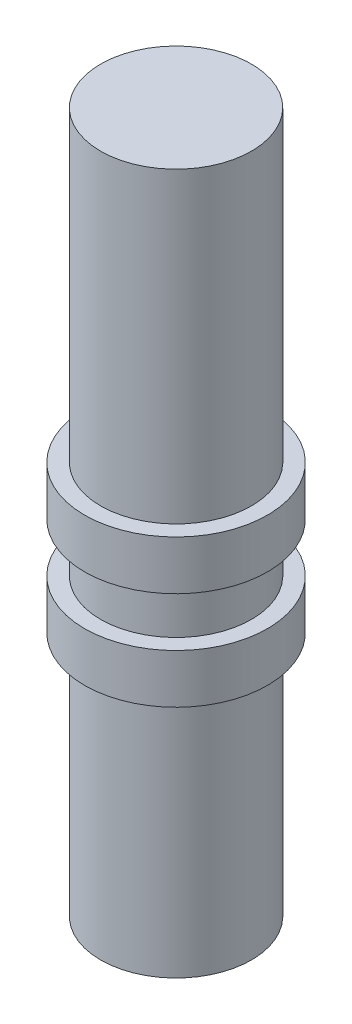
ISO-10303-21;
HEADER;
FILE_DESCRIPTION(('STEP AP214'),'2;1');
FILE_NAME('part.step','',(''),(''),'','','');
FILE_SCHEMA(('AUTOMOTIVE_DESIGN { 1 0 10303 214 1 1 1 1 }'));
ENDSEC;
DATA;
#1=APPLICATION_CONTEXT('core data for automotive mechanical design processes');
#2=APPLICATION_PROTOCOL_DEFINITION('international standard','automotive_design',2000,#1);
#3=PRODUCT_CONTEXT('',#1,'mechanical');
#4=PRODUCT('Part','Part','',(#3));
#5=PRODUCT_RELATED_PRODUCT_CATEGORY('part','',(#4));
#6=PRODUCT_DEFINITION_FORMATION('','',#4);
#7=PRODUCT_DEFINITION_CONTEXT('part definition',#1,'design');
#8=PRODUCT_DEFINITION('design','',#6,#7);
#9=PRODUCT_DEFINITION_SHAPE('','',#8);
#10=(LENGTH_UNIT() NAMED_UNIT(*) SI_UNIT(.MILLI.,.METRE.));
#11=(NAMED_UNIT(*) PLANE_ANGLE_UNIT() SI_UNIT($,.RADIAN.));
#12=(NAMED_UNIT(*) SI_UNIT($,.STERADIAN.) SOLID_ANGLE_UNIT());
#13=UNCERTAINTY_MEASURE_WITH_UNIT(LENGTH_MEASURE(1.E-05),#10,'distance_accuracy_value','');
#14=(GEOMETRIC_REPRESENTATION_CONTEXT(3) GLOBAL_UNCERTAINTY_ASSIGNED_CONTEXT((#13)) GLOBAL_UNIT_ASSIGNED_CONTEXT((#10,
#11,#12)) REPRESENTATION_CONTEXT('',''));
#15=CARTESIAN_POINT('',(0.,0.,0.));
#16=DIRECTION('',(0.,0.,1.));
#17=DIRECTION('',(1.,0.,0.));
#18=AXIS2_PLACEMENT_3D('',#15,#16,#17);
#19=CARTESIAN_POINT('',(0.,20.32,0.));
#20=DIRECTION('',(0.,1.,0.));
#21=DIRECTION('',(0.,0.,1.));
#22=AXIS2_PLACEMENT_3D('',#19,#20,#21);
#23=PLANE('',#22);
#24=CARTESIAN_POINT('',(0.,20.32,0.));
#25=DIRECTION('',(0.,1.,0.));
#26=DIRECTION('',(0.,0.,1.));
#27=AXIS2_PLACEMENT_3D('',#24,#25,#26);
#28=CIRCLE('',#27,4.7244);
#29=CARTESIAN_POINT('',(0.,20.32,4.7244));
#30=VERTEX_POINT('',#29);
#31=EDGE_CURVE('E52',#30,#30,#28,.T.);
#32=ORIENTED_EDGE('',*,*,#31,.T.);
#33=EDGE_LOOP('',(#32));
#34=FACE_BOUND('',#33,.T.);
#35=CARTESIAN_POINT('',(0.,20.32,0.));
#36=DIRECTION('',(0.,1.,0.));
#37=DIRECTION('',(0.,0.,1.));
#38=AXIS2_PLACEMENT_3D('',#35,#36,#37);
#39=CIRCLE('',#38,3.8989);
#40=CARTESIAN_POINT('',(0.,20.32,3.8989));
#41=VERTEX_POINT('',#40);
#42=EDGE_CURVE('E61',#41,#41,#39,.T.);
#43=ORIENTED_EDGE('',*,*,#42,.F.);
#44=EDGE_LOOP('',(#43));
#45=FACE_BOUND('',#44,.T.);
#46=ADVANCED_FACE('F30',(#34,#45),#23,.T.);
#47=CARTESIAN_POINT('',(0.,15.24,0.));
#48=DIRECTION('',(0.,1.,0.));
#49=DIRECTION('',(0.,0.,1.));
#50=AXIS2_PLACEMENT_3D('',#47,#48,#49);
#51=PLANE('',#50);
#52=CARTESIAN_POINT('',(0.,15.24,0.));
#53=DIRECTION('',(0.,1.,0.));
#54=DIRECTION('',(0.,0.,1.));
#55=AXIS2_PLACEMENT_3D('',#52,#53,#54);
#56=CIRCLE('',#55,4.7244);
#57=CARTESIAN_POINT('',(0.,15.24,4.7244));
#58=VERTEX_POINT('',#57);
#59=EDGE_CURVE('E41',#58,#58,#56,.T.);
#60=ORIENTED_EDGE('',*,*,#59,.T.);
#61=EDGE_LOOP('',(#60));
#62=FACE_BOUND('',#61,.T.);
#63=CARTESIAN_POINT('',(0.,15.24,0.));
#64=DIRECTION('',(0.,1.,0.));
#65=DIRECTION('',(0.,0.,1.));
#66=AXIS2_PLACEMENT_3D('',#63,#64,#65);
#67=CIRCLE('',#66,3.8989);
#68=CARTESIAN_POINT('',(0.,15.24,3.8989));
#69=VERTEX_POINT('',#68);
#70=EDGE_CURVE('E49',#69,#69,#67,.T.);
#71=ORIENTED_EDGE('',*,*,#70,.F.);
#72=EDGE_LOOP('',(#71));
#73=FACE_BOUND('',#72,.T.);
#74=ADVANCED_FACE('F89',(#62,#73),#51,.T.);
#75=CARTESIAN_POINT('',(0.,12.7,0.));
#76=DIRECTION('',(0.,-1.,0.));
#77=DIRECTION('',(0.,0.,-1.));
#78=AXIS2_PLACEMENT_3D('',#75,#76,#77);
#79=CYLINDRICAL_SURFACE('',#78,3.8989);
#80=CARTESIAN_POINT('',(0.,12.7,0.));
#81=DIRECTION('',(0.,1.,0.));
#82=DIRECTION('',(0.,0.,1.));
#83=AXIS2_PLACEMENT_3D('',#80,#81,#82);
#84=CIRCLE('',#83,3.8989);
#85=CARTESIAN_POINT('',(0.,12.7,3.8989));
#86=VERTEX_POINT('',#85);
#87=EDGE_CURVE('E10',#86,#86,#84,.T.);
#88=ORIENTED_EDGE('',*,*,#87,.F.);
#89=EDGE_LOOP('',(#88));
#90=FACE_BOUND('',#89,.T.);
#91=CARTESIAN_POINT('',(0.,0.,0.));
#92=DIRECTION('',(0.,1.,0.));
#93=DIRECTION('',(0.,0.,1.));
#94=AXIS2_PLACEMENT_3D('',#91,#92,#93);
#95=CIRCLE('',#94,3.8989);
#96=CARTESIAN_POINT('',(0.,0.,3.8989));
#97=VERTEX_POINT('',#96);
#98=EDGE_CURVE('E34',#97,#97,#95,.T.);
#99=ORIENTED_EDGE('',*,*,#98,.T.);
#100=EDGE_LOOP('',(#99));
#101=FACE_BOUND('',#100,.T.);
#102=ADVANCED_FACE('F32',(#90,#101),#79,.T.);
#103=CARTESIAN_POINT('',(0.,0.,0.));
#104=DIRECTION('',(0.,1.,0.));
#105=DIRECTION('',(0.,0.,1.));
#106=AXIS2_PLACEMENT_3D('',#103,#104,#105);
#107=PLANE('',#106);
#108=CARTESIAN_POINT('',(0.,0.,0.));
#109=DIRECTION('',(0.,-1.,0.));
#110=DIRECTION('',(0.,0.,-1.));
#111=AXIS2_PLACEMENT_3D('',#108,#109,#110);
#112=CIRCLE('',#111,3.175);
#113=CARTESIAN_POINT('',(0.,0.,-3.175));
#114=VERTEX_POINT('',#113);
#115=EDGE_CURVE('E67',#114,#114,#112,.T.);
#116=ORIENTED_EDGE('',*,*,#115,.F.);
#117=EDGE_LOOP('',(#116));
#118=FACE_BOUND('',#117,.T.);
#119=ORIENTED_EDGE('',*,*,#98,.F.);
#120=EDGE_LOOP('',(#119));
#121=FACE_BOUND('',#120,.T.);
#122=ADVANCED_FACE('F82',(#118,#121),#107,.F.);
#123=CARTESIAN_POINT('',(0.,12.7,0.));
#124=DIRECTION('',(0.,1.,0.));
#125=DIRECTION('',(0.,0.,1.));
#126=AXIS2_PLACEMENT_3D('',#123,#124,#125);
#127=PLANE('',#126);
#128=CARTESIAN_POINT('',(0.,12.7,0.));
#129=DIRECTION('',(0.,1.,0.));
#130=DIRECTION('',(0.,0.,1.));
#131=AXIS2_PLACEMENT_3D('',#128,#129,#130);
#132=CIRCLE('',#131,4.7244);
#133=CARTESIAN_POINT('',(0.,12.7,4.7244));
#134=VERTEX_POINT('',#133);
#135=EDGE_CURVE('E43',#134,#134,#132,.T.);
#136=ORIENTED_EDGE('',*,*,#135,.F.);
#137=EDGE_LOOP('',(#136));
#138=FACE_BOUND('',#137,.T.);
#139=ORIENTED_EDGE('',*,*,#87,.T.);
#140=EDGE_LOOP('',(#139));
#141=FACE_BOUND('',#140,.T.);
#142=ADVANCED_FACE('F85',(#138,#141),#127,.F.);
#143=CARTESIAN_POINT('',(0.,15.24,0.));
#144=DIRECTION('',(0.,-1.,0.));
#145=DIRECTION('',(0.,0.,-1.));
#146=AXIS2_PLACEMENT_3D('',#143,#144,#145);
#147=CYLINDRICAL_SURFACE('',#146,4.7244);
#148=ORIENTED_EDGE('',*,*,#59,.F.);
#149=EDGE_LOOP('',(#148));
#150=FACE_BOUND('',#149,.T.);
#151=ORIENTED_EDGE('',*,*,#135,.T.);
#152=EDGE_LOOP('',(#151));
#153=FACE_BOUND('',#152,.T.);
#154=ADVANCED_FACE('F116',(#150,#153),#147,.T.);
#155=CARTESIAN_POINT('',(0.,17.78,0.));
#156=DIRECTION('',(0.,-1.,0.));
#157=DIRECTION('',(0.,0.,-1.));
#158=AXIS2_PLACEMENT_3D('',#155,#156,#157);
#159=CYLINDRICAL_SURFACE('',#158,3.8989);
#160=CARTESIAN_POINT('',(0.,17.78,0.));
#161=DIRECTION('',(0.,1.,0.));
#162=DIRECTION('',(0.,0.,1.));
#163=AXIS2_PLACEMENT_3D('',#160,#161,#162);
#164=CIRCLE('',#163,3.8989);
#165=CARTESIAN_POINT('',(0.,17.78,3.8989));
#166=VERTEX_POINT('',#165);
#167=EDGE_CURVE('E46',#166,#166,#164,.T.);
#168=ORIENTED_EDGE('',*,*,#167,.F.);
#169=EDGE_LOOP('',(#168));
#170=FACE_BOUND('',#169,.T.);
#171=ORIENTED_EDGE('',*,*,#70,.T.);
#172=EDGE_LOOP('',(#171));
#173=FACE_BOUND('',#172,.T.);
#174=ADVANCED_FACE('F110',(#170,#173),#159,.T.);
#175=CARTESIAN_POINT('',(0.,17.78,0.));
#176=DIRECTION('',(0.,1.,0.));
#177=DIRECTION('',(0.,0.,1.));
#178=AXIS2_PLACEMENT_3D('',#175,#176,#177);
#179=PLANE('',#178);
#180=CARTESIAN_POINT('',(0.,17.78,0.));
#181=DIRECTION('',(0.,1.,0.));
#182=DIRECTION('',(0.,0.,1.));
#183=AXIS2_PLACEMENT_3D('',#180,#181,#182);
#184=CIRCLE('',#183,4.7244);
#185=CARTESIAN_POINT('',(0.,17.78,4.7244));
#186=VERTEX_POINT('',#185);
#187=EDGE_CURVE('E55',#186,#186,#184,.T.);
#188=ORIENTED_EDGE('',*,*,#187,.F.);
#189=EDGE_LOOP('',(#188));
#190=FACE_BOUND('',#189,.T.);
#191=ORIENTED_EDGE('',*,*,#167,.T.);
#192=EDGE_LOOP('',(#191));
#193=FACE_BOUND('',#192,.T.);
#194=ADVANCED_FACE('F106',(#190,#193),#179,.F.);
#195=CARTESIAN_POINT('',(0.,20.32,0.));
#196=DIRECTION('',(0.,-1.,0.));
#197=DIRECTION('',(0.,0.,-1.));
#198=AXIS2_PLACEMENT_3D('',#195,#196,#197);
#199=CYLINDRICAL_SURFACE('',#198,4.7244);
#200=ORIENTED_EDGE('',*,*,#31,.F.);
#201=EDGE_LOOP('',(#200));
#202=FACE_BOUND('',#201,.T.);
#203=ORIENTED_EDGE('',*,*,#187,.T.);
#204=EDGE_LOOP('',(#203));
#205=FACE_BOUND('',#204,.T.);
#206=ADVANCED_FACE('F109',(#202,#205),#199,.T.);
#207=CARTESIAN_POINT('',(0.,36.195,0.));
#208=DIRECTION('',(0.,-1.,0.));
#209=DIRECTION('',(0.,0.,-1.));
#210=AXIS2_PLACEMENT_3D('',#207,#208,#209);
#211=CYLINDRICAL_SURFACE('',#210,3.8989);
#212=CARTESIAN_POINT('',(0.,36.195,0.));
#213=DIRECTION('',(0.,1.,0.));
#214=DIRECTION('',(0.,0.,1.));
#215=AXIS2_PLACEMENT_3D('',#212,#213,#214);
#216=CIRCLE('',#215,3.8989);
#217=CARTESIAN_POINT('',(0.,36.195,3.8989));
#218=VERTEX_POINT('',#217);
#219=EDGE_CURVE('E58',#218,#218,#216,.T.);
#220=ORIENTED_EDGE('',*,*,#219,.F.);
#221=EDGE_LOOP('',(#220));
#222=FACE_BOUND('',#221,.T.);
#223=ORIENTED_EDGE('',*,*,#42,.T.);
#224=EDGE_LOOP('',(#223));
#225=FACE_BOUND('',#224,.T.);
#226=ADVANCED_FACE('F104',(#222,#225),#211,.T.);
#227=CARTESIAN_POINT('',(0.,36.195,0.));
#228=DIRECTION('',(0.,1.,0.));
#229=DIRECTION('',(0.,0.,1.));
#230=AXIS2_PLACEMENT_3D('',#227,#228,#229);
#231=PLANE('',#230);
#232=ORIENTED_EDGE('',*,*,#219,.T.);
#233=EDGE_LOOP('',(#232));
#234=FACE_BOUND('',#233,.T.);
#235=ADVANCED_FACE('F78',(#234),#231,.T.);
#236=CARTESIAN_POINT('',(0.,6.35,0.));
#237=DIRECTION('',(0.,-1.,0.));
#238=DIRECTION('',(0.,0.,-1.));
#239=AXIS2_PLACEMENT_3D('',#236,#237,#238);
#240=CYLINDRICAL_SURFACE('',#239,3.175);
#241=CARTESIAN_POINT('',(0.,6.35,0.));
#242=DIRECTION('',(0.,-1.,0.));
#243=DIRECTION('',(0.,0.,-1.));
#244=AXIS2_PLACEMENT_3D('',#241,#242,#243);
#245=CIRCLE('',#244,3.175);
#246=CARTESIAN_POINT('',(0.,6.35,-3.175));
#247=VERTEX_POINT('',#246);
#248=EDGE_CURVE('E64',#247,#247,#245,.T.);
#249=ORIENTED_EDGE('',*,*,#248,.F.);
#250=EDGE_LOOP('',(#249));
#251=FACE_BOUND('',#250,.T.);
#252=ORIENTED_EDGE('',*,*,#115,.T.);
#253=EDGE_LOOP('',(#252));
#254=FACE_BOUND('',#253,.T.);
#255=ADVANCED_FACE('F75',(#251,#254),#240,.F.);
#256=CARTESIAN_POINT('',(0.,6.35,0.));
#257=DIRECTION('',(0.,-1.,0.));
#258=DIRECTION('',(0.,0.,-1.));
#259=AXIS2_PLACEMENT_3D('',#256,#257,#258);
#260=PLANE('',#259);
#261=ORIENTED_EDGE('',*,*,#248,.T.);
#262=EDGE_LOOP('',(#261));
#263=FACE_BOUND('',#262,.T.);
#264=ADVANCED_FACE('F73',(#263),#260,.T.);
#265=CLOSED_SHELL('',(#46,#74,#102,#122,#142,#154,#174,#194,#206,#226,#235,#255,#264));
#266=MANIFOLD_SOLID_BREP('B2',#265);
#267=ADVANCED_BREP_SHAPE_REPRESENTATION('',(#18,#266),#14);
#268=SHAPE_DEFINITION_REPRESENTATION(#9,#267);
ENDSEC;
END-ISO-10303-21;
